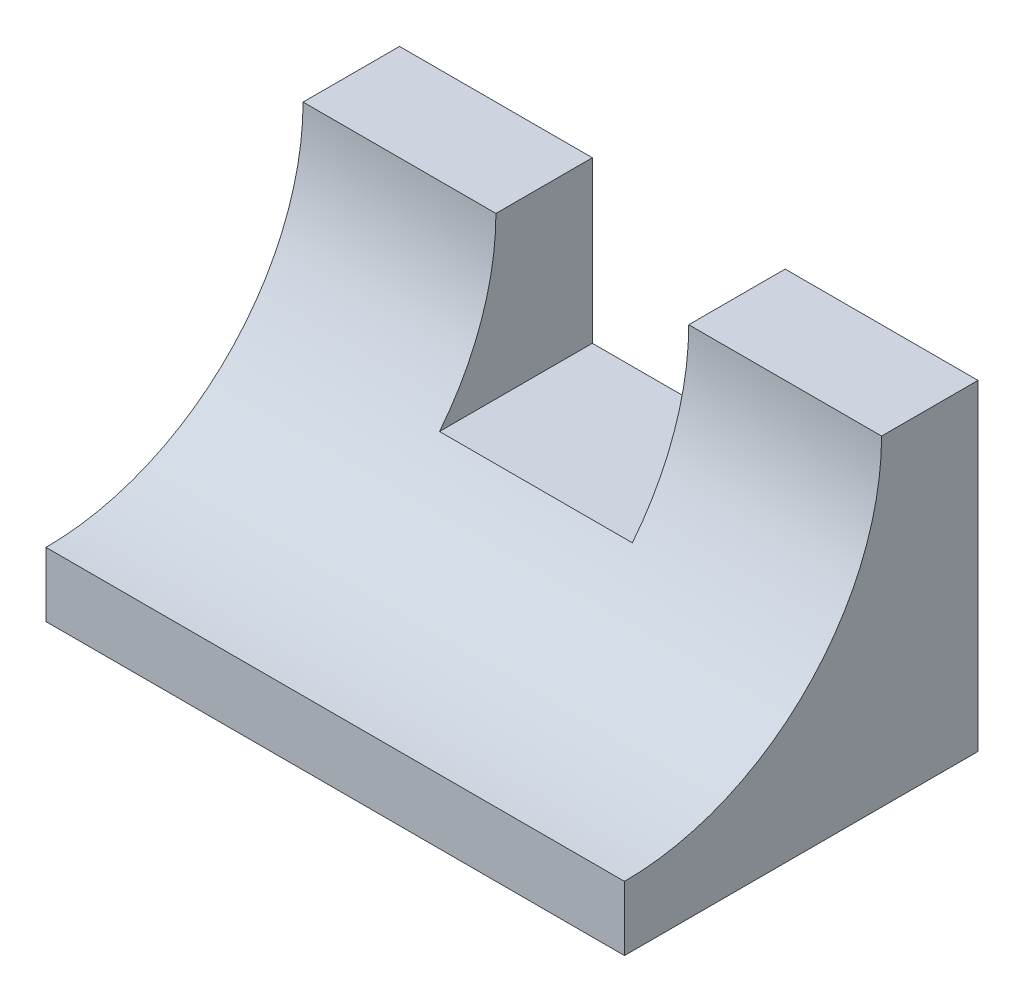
from build123d import *

# Parameters (mm, degrees)
SKETCH_1_W          = 90
SKETCH_1_H          = 55
EXTRUDE_1_DEPTH     = 50
SKETCH_2_R          = 40
CUT_EXTRUDE_1_DEPTH = 117.726175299
SKETCH_3_W          = 30
SKETCH_3_H          = 25
CUT_EXTRUDE_2_DEPTH = 117.726175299


with BuildPart() as part:
    # Sketch 1 → Extrude 1 (new body)
    with BuildSketch(Plane(origin=(0, 0, 0), x_dir=(1, 0, 0), z_dir=(0, 1, 0))):
        with Locations((45, 27.5)):
            Rectangle(SKETCH_1_W, SKETCH_1_H)
    extrude(amount=EXTRUDE_1_DEPTH)

    # Sketch 2 → Cut-Extrude 1 (cut, through all)
    with BuildSketch(Plane(origin=(90, 0, 0), x_dir=(0, 0, -1), z_dir=(1, 0, 0))):
        with Locations((0, 50)):
            Circle(SKETCH_2_R)
    extrude(amount=-CUT_EXTRUDE_1_DEPTH, mode=Mode.SUBTRACT)

    # Sketch 3 → Cut-Extrude 2 (cut, through all)
    with BuildSketch(Plane.XY):
        with Locations((45, 37.5)):
            Rectangle(SKETCH_3_W, SKETCH_3_H)
    extrude(amount=-CUT_EXTRUDE_2_DEPTH, mode=Mode.SUBTRACT)


solid = part.part
